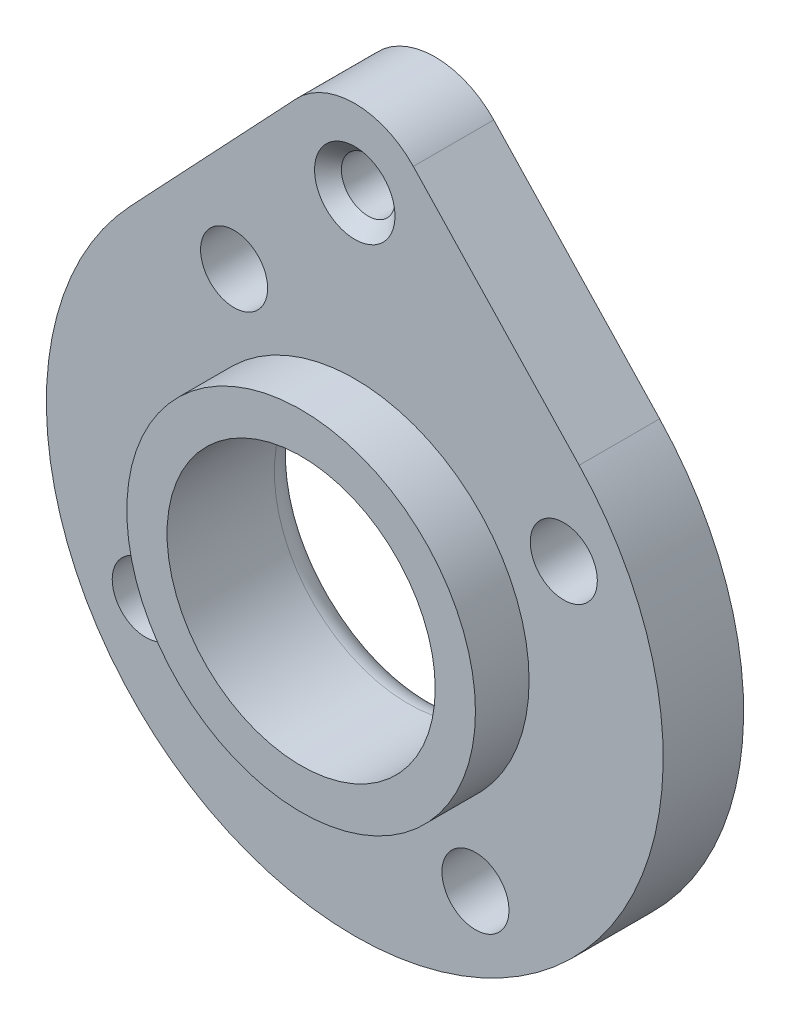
from build123d import *

# Parameters (mm, degrees)
SKETCH_1_R      = 2.5
SKETCH_1_R_2    = 10
EXTRUDE_1_DEPTH = 6
SKETCH_2_R      = 13
SKETCH_2_R_2    = 10
EXTRUDE_2_DEPTH = 4
FILLET_1_R      = 2


with BuildPart() as part:
    # Sketch 1 → Extrude 1 (new body)
    with BuildSketch(Plane.XY):
        with BuildLine():
            Line((4.365419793, 28.896332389), (16.734109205, 15.778770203))
            ThreePointArc((16.734109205, 15.778770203), (0, -23), (-16.734109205, 15.778770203))
            Line((-16.734109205, 15.778770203), (-4.365419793, 28.896332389))
            ThreePointArc((-4.365419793, 28.896332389), (0, 30.780131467), (4.365419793, 28.896332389))
        make_face()
        with Locations(Location((9, -15.588457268, 0), (0, 0, 180))):
            Circle(SKETCH_1_R, mode=Mode.SUBTRACT)
        with Locations((-9, 15.588457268)):
            Circle(SKETCH_1_R, mode=Mode.SUBTRACT)
        with Locations((15.588457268, 9)):
            Circle(SKETCH_1_R, mode=Mode.SUBTRACT)
        with Locations(Location((-15.588457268, -9, 0), (0, 0, 180))):
            Circle(SKETCH_1_R, mode=Mode.SUBTRACT)
        Circle(SKETCH_1_R_2, mode=Mode.SUBTRACT)
    extrude(amount=EXTRUDE_1_DEPTH)

    # Sketch 2 → Extrude 2 (add)
    with BuildSketch(Plane.XY.offset(6)):
        Circle(SKETCH_2_R)
        Circle(SKETCH_2_R_2, mode=Mode.SUBTRACT)
    extrude(amount=EXTRUDE_2_DEPTH)

    # Sketch 4 → Cut-Revolve 1 (revolve, cut)
    with BuildSketch(Plane(origin=(0, 0, 0), x_dir=(0, 0, -1), z_dir=(1, 0, 0)), mode=Mode.PRIVATE) as cut_revolve_1_sk:
        Polygon((-6, 28), (-5, 27), (0, 27), (0, 25), (-6, 25), align=None)
    revolve(cut_revolve_1_sk.sketch.rotate(Axis((0, 25, 0), (0, 0, 1)), 90), axis=Axis((0, 25, 0), (0, 0, 1)), mode=Mode.SUBTRACT)

    # Fillet 1
    fillet_1_edges = [part.edges().sort_by_distance(p)[0] for p in [
        (-10, 0, 0),
    ]]
    fillet(fillet_1_edges, radius=FILLET_1_R)


solid = part.part
